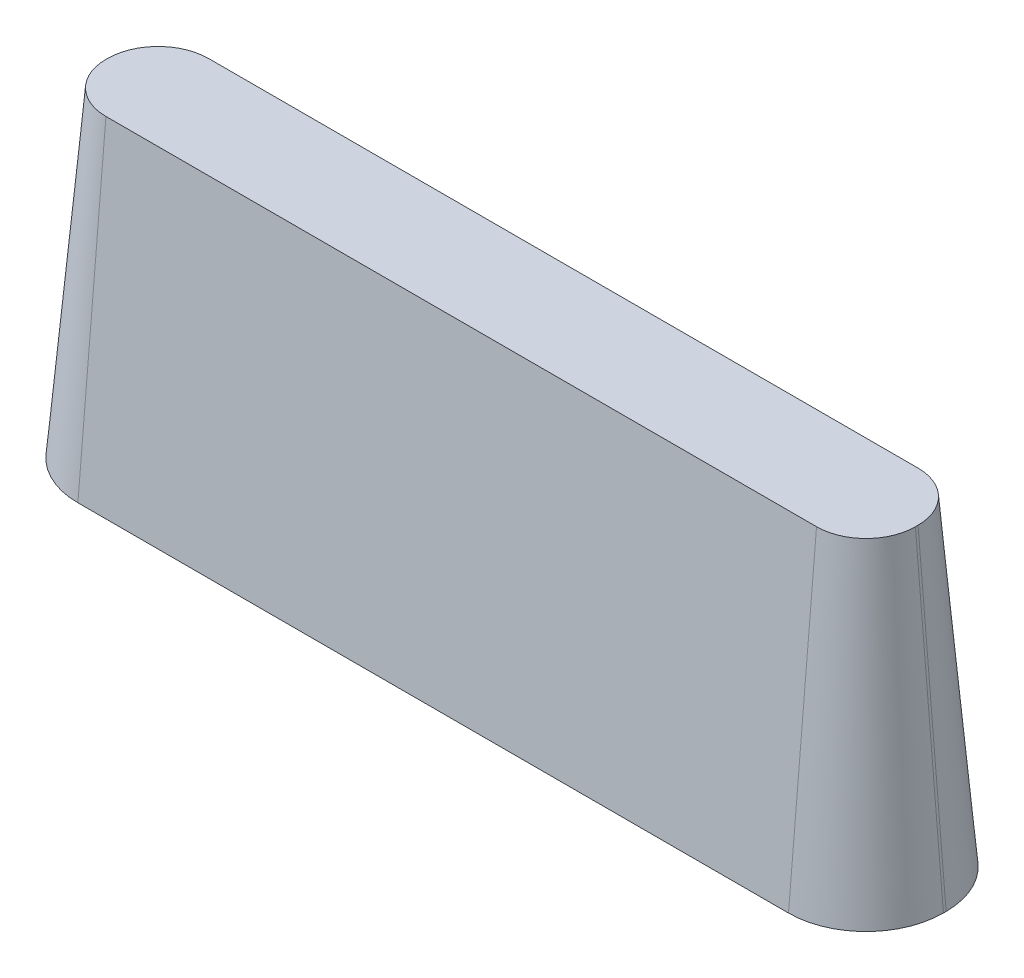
ISO-10303-21;
HEADER;
FILE_DESCRIPTION(('STEP AP214'),'2;1');
FILE_NAME('part.step','',(''),(''),'','','');
FILE_SCHEMA(('AUTOMOTIVE_DESIGN { 1 0 10303 214 1 1 1 1 }'));
ENDSEC;
DATA;
#1=APPLICATION_CONTEXT('core data for automotive mechanical design processes');
#2=APPLICATION_PROTOCOL_DEFINITION('international standard','automotive_design',2000,#1);
#3=PRODUCT_CONTEXT('',#1,'mechanical');
#4=PRODUCT('Part','Part','',(#3));
#5=PRODUCT_RELATED_PRODUCT_CATEGORY('part','',(#4));
#6=PRODUCT_DEFINITION_FORMATION('','',#4);
#7=PRODUCT_DEFINITION_CONTEXT('part definition',#1,'design');
#8=PRODUCT_DEFINITION('design','',#6,#7);
#9=PRODUCT_DEFINITION_SHAPE('','',#8);
#10=(LENGTH_UNIT() NAMED_UNIT(*) SI_UNIT(.MILLI.,.METRE.));
#11=(NAMED_UNIT(*) PLANE_ANGLE_UNIT() SI_UNIT($,.RADIAN.));
#12=(NAMED_UNIT(*) SI_UNIT($,.STERADIAN.) SOLID_ANGLE_UNIT());
#13=UNCERTAINTY_MEASURE_WITH_UNIT(LENGTH_MEASURE(1.E-05),#10,'distance_accuracy_value','');
#14=(GEOMETRIC_REPRESENTATION_CONTEXT(3) GLOBAL_UNCERTAINTY_ASSIGNED_CONTEXT((#13)) GLOBAL_UNIT_ASSIGNED_CONTEXT((#10,
#11,#12)) REPRESENTATION_CONTEXT('',''));
#15=CARTESIAN_POINT('',(0.,0.,0.));
#16=DIRECTION('',(0.,0.,1.));
#17=DIRECTION('',(1.,0.,0.));
#18=AXIS2_PLACEMENT_3D('',#15,#16,#17);
#19=CARTESIAN_POINT('',(79.4097630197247,0.,-292.536387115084));
#20=DIRECTION('',(0.,-1.,0.));
#21=DIRECTION('',(0.,0.,1.));
#22=AXIS2_PLACEMENT_3D('',#19,#20,#21);
#23=CONICAL_SURFACE('',#22,149.86,0.0872664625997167);
#24=CARTESIAN_POINT('',(79.4097630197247,0.,-292.536387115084));
#25=DIRECTION('',(0.,1.,0.));
#26=DIRECTION('',(0.,0.,1.));
#27=AXIS2_PLACEMENT_3D('',#24,#25,#26);
#28=CIRCLE('',#27,149.86);
#29=CARTESIAN_POINT('',(-70.4502369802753,0.,-292.536387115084));
#30=VERTEX_POINT('',#29);
#31=CARTESIAN_POINT('',(79.4097630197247,0.,-442.396387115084));
#32=VERTEX_POINT('',#31);
#33=EDGE_CURVE('E193',#30,#32,#28,.F.);
#34=ORIENTED_EDGE('',*,*,#33,.F.);
#35=DIRECTION('',(-0.0871557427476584,-0.996194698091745,0.));
#36=VECTOR('',#35,1.);
#37=CARTESIAN_POINT('',(-70.4502369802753,0.,-292.536387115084));
#38=LINE('',#37,#36);
#39=CARTESIAN_POINT('',(-17.1171476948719,609.6,-292.536387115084));
#40=VERTEX_POINT('',#39);
#41=EDGE_CURVE('E11',#40,#30,#38,.T.);
#42=ORIENTED_EDGE('',*,*,#41,.F.);
#43=CARTESIAN_POINT('',(79.4097630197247,609.6,-292.536387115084));
#44=DIRECTION('',(0.,1.,0.));
#45=DIRECTION('',(0.,0.,1.));
#46=AXIS2_PLACEMENT_3D('',#43,#44,#45);
#47=CIRCLE('',#46,96.5269107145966);
#48=CARTESIAN_POINT('',(79.4097630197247,609.6,-389.063297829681));
#49=VERTEX_POINT('',#48);
#50=EDGE_CURVE('E247',#40,#49,#47,.F.);
#51=ORIENTED_EDGE('',*,*,#50,.T.);
#52=DIRECTION('',(0.,-0.996194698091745,-0.0871557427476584));
#53=VECTOR('',#52,1.);
#54=CARTESIAN_POINT('',(79.4097630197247,0.,-442.396387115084));
#55=LINE('',#54,#53);
#56=EDGE_CURVE('E50',#49,#32,#55,.T.);
#57=ORIENTED_EDGE('',*,*,#56,.T.);
#58=EDGE_LOOP('',(#34,#42,#51,#57));
#59=FACE_BOUND('',#58,.T.);
#60=ADVANCED_FACE('F33',(#59),#23,.T.);
#61=CARTESIAN_POINT('',(-70.4502369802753,0.,-292.536387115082));
#62=DIRECTION('',(-0.996194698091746,0.0871557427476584,0.));
#63=DIRECTION('',(-0.0871557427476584,-0.996194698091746,0.));
#64=AXIS2_PLACEMENT_3D('',#61,#62,#63);
#65=PLANE('',#64);
#66=DIRECTION('',(0.,0.,1.));
#67=VECTOR('',#66,1.);
#68=CARTESIAN_POINT('',(-70.4502369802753,0.,-292.536387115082));
#69=LINE('',#68,#67);
#70=CARTESIAN_POINT('',(-70.4502369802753,0.,-289.996387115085));
#71=VERTEX_POINT('',#70);
#72=EDGE_CURVE('E227',#30,#71,#69,.T.);
#73=ORIENTED_EDGE('',*,*,#72,.T.);
#74=DIRECTION('',(-0.0871557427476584,-0.996194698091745,0.));
#75=VECTOR('',#74,1.);
#76=CARTESIAN_POINT('',(-70.4502369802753,0.,-289.996387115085));
#77=LINE('',#76,#75);
#78=CARTESIAN_POINT('',(-17.1171476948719,609.6,-289.996387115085));
#79=VERTEX_POINT('',#78);
#80=EDGE_CURVE('E42',#79,#71,#77,.T.);
#81=ORIENTED_EDGE('',*,*,#80,.F.);
#82=DIRECTION('',(0.,0.,-1.));
#83=VECTOR('',#82,1.);
#84=CARTESIAN_POINT('',(-17.1171476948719,609.6,-292.536387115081));
#85=LINE('',#84,#83);
#86=EDGE_CURVE('E261',#40,#79,#85,.F.);
#87=ORIENTED_EDGE('',*,*,#86,.F.);
#88=ORIENTED_EDGE('',*,*,#41,.T.);
#89=EDGE_LOOP('',(#73,#81,#87,#88));
#90=FACE_BOUND('',#89,.T.);
#91=ADVANCED_FACE('F35',(#90),#65,.T.);
#92=CARTESIAN_POINT('',(76.8697630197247,0.,-289.996387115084));
#93=DIRECTION('',(0.,-1.,0.));
#94=DIRECTION('',(0.,0.,1.));
#95=AXIS2_PLACEMENT_3D('',#92,#93,#94);
#96=CONICAL_SURFACE('',#95,147.32,0.0872664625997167);
#97=CARTESIAN_POINT('',(76.8697630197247,0.,-289.996387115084));
#98=DIRECTION('',(0.,1.,0.));
#99=DIRECTION('',(0.,0.,1.));
#100=AXIS2_PLACEMENT_3D('',#97,#98,#99);
#101=CIRCLE('',#100,147.32);
#102=CARTESIAN_POINT('',(76.8697630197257,0.,-142.676387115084));
#103=VERTEX_POINT('',#102);
#104=EDGE_CURVE('E230',#103,#71,#101,.F.);
#105=ORIENTED_EDGE('',*,*,#104,.F.);
#106=DIRECTION('',(0.,-0.996194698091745,0.0871557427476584));
#107=VECTOR('',#106,1.);
#108=CARTESIAN_POINT('',(76.8697630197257,0.,-142.676387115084));
#109=LINE('',#108,#107);
#110=CARTESIAN_POINT('',(76.8697630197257,609.6,-196.009476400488));
#111=VERTEX_POINT('',#110);
#112=EDGE_CURVE('E257',#111,#103,#109,.T.);
#113=ORIENTED_EDGE('',*,*,#112,.F.);
#114=CARTESIAN_POINT('',(76.8697630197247,609.6,-289.996387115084));
#115=DIRECTION('',(0.,1.,0.));
#116=DIRECTION('',(0.,0.,1.));
#117=AXIS2_PLACEMENT_3D('',#114,#115,#116);
#118=CIRCLE('',#117,93.9869107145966);
#119=EDGE_CURVE('E263',#111,#79,#118,.F.);
#120=ORIENTED_EDGE('',*,*,#119,.T.);
#121=ORIENTED_EDGE('',*,*,#80,.T.);
#122=EDGE_LOOP('',(#105,#113,#120,#121));
#123=FACE_BOUND('',#122,.T.);
#124=ADVANCED_FACE('F299',(#123),#96,.T.);
#125=CARTESIAN_POINT('',(-553.509119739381,0.,-142.676387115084));
#126=DIRECTION('',(0.,0.0871557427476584,0.996194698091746));
#127=DIRECTION('',(0.,-0.996194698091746,0.0871557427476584));
#128=AXIS2_PLACEMENT_3D('',#125,#126,#127);
#129=PLANE('',#128);
#130=DIRECTION('',(1.,0.,0.));
#131=VECTOR('',#130,1.);
#132=CARTESIAN_POINT('',(-553.509119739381,0.,-142.676387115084));
#133=LINE('',#132,#131);
#134=CARTESIAN_POINT('',(1428.14976301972,0.,-142.676387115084));
#135=VERTEX_POINT('',#134);
#136=EDGE_CURVE('E233',#103,#135,#133,.T.);
#137=ORIENTED_EDGE('',*,*,#136,.T.);
#138=DIRECTION('',(0.,-0.996194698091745,0.0871557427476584));
#139=VECTOR('',#138,1.);
#140=CARTESIAN_POINT('',(1428.14976301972,0.,-142.676387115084));
#141=LINE('',#140,#139);
#142=CARTESIAN_POINT('',(1428.14976301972,609.6,-196.009476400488));
#143=VERTEX_POINT('',#142);
#144=EDGE_CURVE('E255',#143,#135,#141,.T.);
#145=ORIENTED_EDGE('',*,*,#144,.F.);
#146=DIRECTION('',(-1.,0.,0.));
#147=VECTOR('',#146,1.);
#148=CARTESIAN_POINT('',(-553.509119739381,609.6,-196.009476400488));
#149=LINE('',#148,#147);
#150=EDGE_CURVE('E266',#111,#143,#149,.F.);
#151=ORIENTED_EDGE('',*,*,#150,.F.);
#152=ORIENTED_EDGE('',*,*,#112,.T.);
#153=EDGE_LOOP('',(#137,#145,#151,#152));
#154=FACE_BOUND('',#153,.T.);
#155=ADVANCED_FACE('F302',(#154),#129,.T.);
#156=CARTESIAN_POINT('',(1428.14976301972,0.,-289.996387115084));
#157=DIRECTION('',(0.,-1.,0.));
#158=DIRECTION('',(0.,0.,1.));
#159=AXIS2_PLACEMENT_3D('',#156,#157,#158);
#160=CONICAL_SURFACE('',#159,147.32,0.0872664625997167);
#161=CARTESIAN_POINT('',(1428.14976301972,0.,-289.996387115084));
#162=DIRECTION('',(0.,1.,0.));
#163=DIRECTION('',(0.,0.,1.));
#164=AXIS2_PLACEMENT_3D('',#161,#162,#163);
#165=CIRCLE('',#164,147.32);
#166=CARTESIAN_POINT('',(1575.46976301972,0.,-289.996387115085));
#167=VERTEX_POINT('',#166);
#168=EDGE_CURVE('E236',#167,#135,#165,.F.);
#169=ORIENTED_EDGE('',*,*,#168,.F.);
#170=DIRECTION('',(0.0871557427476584,-0.996194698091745,0.));
#171=VECTOR('',#170,1.);
#172=CARTESIAN_POINT('',(1575.46976301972,0.,-289.996387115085));
#173=LINE('',#172,#171);
#174=CARTESIAN_POINT('',(1522.13667373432,609.6,-289.996387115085));
#175=VERTEX_POINT('',#174);
#176=EDGE_CURVE('E253',#175,#167,#173,.T.);
#177=ORIENTED_EDGE('',*,*,#176,.F.);
#178=CARTESIAN_POINT('',(1428.14976301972,609.6,-289.996387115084));
#179=DIRECTION('',(0.,1.,0.));
#180=DIRECTION('',(0.,0.,1.));
#181=AXIS2_PLACEMENT_3D('',#178,#179,#180);
#182=CIRCLE('',#181,93.9869107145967);
#183=EDGE_CURVE('E268',#175,#143,#182,.F.);
#184=ORIENTED_EDGE('',*,*,#183,.T.);
#185=ORIENTED_EDGE('',*,*,#144,.T.);
#186=EDGE_LOOP('',(#169,#177,#184,#185));
#187=FACE_BOUND('',#186,.T.);
#188=ADVANCED_FACE('F304',(#187),#160,.T.);
#189=CARTESIAN_POINT('',(1575.46976301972,0.,-292.536387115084));
#190=DIRECTION('',(0.996194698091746,0.0871557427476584,0.));
#191=DIRECTION('',(-0.0871557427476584,0.996194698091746,0.));
#192=AXIS2_PLACEMENT_3D('',#189,#190,#191);
#193=PLANE('',#192);
#194=DIRECTION('',(0.,0.,1.));
#195=VECTOR('',#194,1.);
#196=CARTESIAN_POINT('',(1575.46976301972,0.,-292.536387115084));
#197=LINE('',#196,#195);
#198=CARTESIAN_POINT('',(1575.46976301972,0.,-295.076387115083));
#199=VERTEX_POINT('',#198);
#200=EDGE_CURVE('E239',#199,#167,#197,.T.);
#201=ORIENTED_EDGE('',*,*,#200,.F.);
#202=DIRECTION('',(0.0871557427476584,-0.996194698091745,0.));
#203=VECTOR('',#202,1.);
#204=CARTESIAN_POINT('',(1575.46976301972,0.,-295.076387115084));
#205=LINE('',#204,#203);
#206=CARTESIAN_POINT('',(1522.13667373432,609.6,-295.076387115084));
#207=VERTEX_POINT('',#206);
#208=EDGE_CURVE('E251',#207,#199,#205,.T.);
#209=ORIENTED_EDGE('',*,*,#208,.F.);
#210=DIRECTION('',(0.,0.,1.));
#211=VECTOR('',#210,1.);
#212=CARTESIAN_POINT('',(1522.13667373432,609.6,-292.536387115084));
#213=LINE('',#212,#211);
#214=EDGE_CURVE('E271',#207,#175,#213,.T.);
#215=ORIENTED_EDGE('',*,*,#214,.T.);
#216=ORIENTED_EDGE('',*,*,#176,.T.);
#217=EDGE_LOOP('',(#201,#209,#215,#216));
#218=FACE_BOUND('',#217,.T.);
#219=ADVANCED_FACE('F283',(#218),#193,.T.);
#220=CARTESIAN_POINT('',(1428.14976301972,0.,-295.076387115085));
#221=DIRECTION('',(0.,-1.,0.));
#222=DIRECTION('',(0.,0.,1.));
#223=AXIS2_PLACEMENT_3D('',#220,#221,#222);
#224=CONICAL_SURFACE('',#223,147.32,0.0872664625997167);
#225=CARTESIAN_POINT('',(1428.14976301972,0.,-295.076387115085));
#226=DIRECTION('',(0.,1.,0.));
#227=DIRECTION('',(0.,0.,1.));
#228=AXIS2_PLACEMENT_3D('',#225,#226,#227);
#229=CIRCLE('',#228,147.32);
#230=CARTESIAN_POINT('',(1428.14976301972,0.,-442.396387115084));
#231=VERTEX_POINT('',#230);
#232=EDGE_CURVE('E242',#231,#199,#229,.F.);
#233=ORIENTED_EDGE('',*,*,#232,.F.);
#234=DIRECTION('',(0.,-0.996194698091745,-0.0871557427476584));
#235=VECTOR('',#234,1.);
#236=CARTESIAN_POINT('',(1428.14976301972,0.,-442.396387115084));
#237=LINE('',#236,#235);
#238=CARTESIAN_POINT('',(1428.14976301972,609.6,-389.063297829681));
#239=VERTEX_POINT('',#238);
#240=EDGE_CURVE('E58',#239,#231,#237,.T.);
#241=ORIENTED_EDGE('',*,*,#240,.F.);
#242=CARTESIAN_POINT('',(1428.14976301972,609.6,-295.076387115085));
#243=DIRECTION('',(0.,1.,0.));
#244=DIRECTION('',(0.,0.,1.));
#245=AXIS2_PLACEMENT_3D('',#242,#243,#244);
#246=CIRCLE('',#245,93.9869107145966);
#247=EDGE_CURVE('E273',#239,#207,#246,.F.);
#248=ORIENTED_EDGE('',*,*,#247,.T.);
#249=ORIENTED_EDGE('',*,*,#208,.T.);
#250=EDGE_LOOP('',(#233,#241,#248,#249));
#251=FACE_BOUND('',#250,.T.);
#252=ADVANCED_FACE('F285',(#251),#224,.T.);
#253=CARTESIAN_POINT('',(-553.509119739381,0.,-442.396387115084));
#254=DIRECTION('',(0.,0.0871557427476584,-0.996194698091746));
#255=DIRECTION('',(0.,0.996194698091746,0.0871557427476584));
#256=AXIS2_PLACEMENT_3D('',#253,#254,#255);
#257=PLANE('',#256);
#258=DIRECTION('',(1.,0.,0.));
#259=VECTOR('',#258,1.);
#260=CARTESIAN_POINT('',(-553.509119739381,0.,-442.396387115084));
#261=LINE('',#260,#259);
#262=EDGE_CURVE('E245',#32,#231,#261,.T.);
#263=ORIENTED_EDGE('',*,*,#262,.F.);
#264=ORIENTED_EDGE('',*,*,#56,.F.);
#265=DIRECTION('',(1.,0.,0.));
#266=VECTOR('',#265,1.);
#267=CARTESIAN_POINT('',(-553.509119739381,609.6,-389.063297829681));
#268=LINE('',#267,#266);
#269=EDGE_CURVE('E37',#49,#239,#268,.T.);
#270=ORIENTED_EDGE('',*,*,#269,.T.);
#271=ORIENTED_EDGE('',*,*,#240,.T.);
#272=EDGE_LOOP('',(#263,#264,#270,#271));
#273=FACE_BOUND('',#272,.T.);
#274=ADVANCED_FACE('F275',(#273),#257,.T.);
#275=CARTESIAN_POINT('',(-553.509119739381,609.6,-292.536387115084));
#276=DIRECTION('',(0.,1.,0.));
#277=DIRECTION('',(0.,0.,1.));
#278=AXIS2_PLACEMENT_3D('',#275,#276,#277);
#279=PLANE('',#278);
#280=ORIENTED_EDGE('',*,*,#50,.F.);
#281=ORIENTED_EDGE('',*,*,#86,.T.);
#282=ORIENTED_EDGE('',*,*,#119,.F.);
#283=ORIENTED_EDGE('',*,*,#150,.T.);
#284=ORIENTED_EDGE('',*,*,#183,.F.);
#285=ORIENTED_EDGE('',*,*,#214,.F.);
#286=ORIENTED_EDGE('',*,*,#247,.F.);
#287=ORIENTED_EDGE('',*,*,#269,.F.);
#288=EDGE_LOOP('',(#280,#281,#282,#283,#284,#285,#286,#287));
#289=FACE_BOUND('',#288,.T.);
#290=ADVANCED_FACE('F278',(#289),#279,.T.);
#291=CARTESIAN_POINT('',(-553.509119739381,0.,-292.536387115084));
#292=DIRECTION('',(0.,1.,0.));
#293=DIRECTION('',(0.,0.,1.));
#294=AXIS2_PLACEMENT_3D('',#291,#292,#293);
#295=PLANE('',#294);
#296=ORIENTED_EDGE('',*,*,#33,.T.);
#297=ORIENTED_EDGE('',*,*,#262,.T.);
#298=ORIENTED_EDGE('',*,*,#232,.T.);
#299=ORIENTED_EDGE('',*,*,#200,.T.);
#300=ORIENTED_EDGE('',*,*,#168,.T.);
#301=ORIENTED_EDGE('',*,*,#136,.F.);
#302=ORIENTED_EDGE('',*,*,#104,.T.);
#303=ORIENTED_EDGE('',*,*,#72,.F.);
#304=EDGE_LOOP('',(#296,#297,#298,#299,#300,#301,#302,#303));
#305=FACE_BOUND('',#304,.T.);
#306=ADVANCED_FACE('F287',(#305),#295,.F.);
#307=CLOSED_SHELL('',(#60,#91,#124,#155,#188,#219,#252,#274,#290,#306));
#308=CARTESIAN_POINT('',(79.4097630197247,2.54,-292.536387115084));
#309=DIRECTION('',(0.,-1.,0.));
#310=DIRECTION('',(0.,0.,-1.));
#311=AXIS2_PLACEMENT_3D('',#308,#309,#310);
#312=CONICAL_SURFACE('',#311,147.32,0.0872664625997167);
#313=CARTESIAN_POINT('',(79.4097630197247,2.54,-292.536387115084));
#314=DIRECTION('',(0.,-1.,0.));
#315=DIRECTION('',(0.,0.,-1.));
#316=AXIS2_PLACEMENT_3D('',#313,#314,#315);
#317=CIRCLE('',#316,147.32);
#318=CARTESIAN_POINT('',(-67.9102369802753,2.54,-292.536387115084));
#319=VERTEX_POINT('',#318);
#320=CARTESIAN_POINT('',(79.4097630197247,2.54,-439.856387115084));
#321=VERTEX_POINT('',#320);
#322=EDGE_CURVE('E167',#319,#321,#317,.T.);
#323=ORIENTED_EDGE('',*,*,#322,.T.);
#324=DIRECTION('',(0.,-0.996194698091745,-0.0871557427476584));
#325=VECTOR('',#324,1.);
#326=CARTESIAN_POINT('',(79.4097630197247,2.54,-439.856387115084));
#327=LINE('',#326,#325);
#328=CARTESIAN_POINT('',(79.4097630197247,607.06,-386.967740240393));
#329=VERTEX_POINT('',#328);
#330=EDGE_CURVE('E149',#329,#321,#327,.T.);
#331=ORIENTED_EDGE('',*,*,#330,.F.);
#332=CARTESIAN_POINT('',(79.4097630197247,607.06,-292.536387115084));
#333=DIRECTION('',(0.,-1.,0.));
#334=DIRECTION('',(0.,0.,-1.));
#335=AXIS2_PLACEMENT_3D('',#332,#333,#334);
#336=CIRCLE('',#335,94.4313531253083);
#337=CARTESIAN_POINT('',(-15.0215901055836,607.06,-292.536387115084));
#338=VERTEX_POINT('',#337);
#339=EDGE_CURVE('E192',#338,#329,#336,.T.);
#340=ORIENTED_EDGE('',*,*,#339,.F.);
#341=DIRECTION('',(-0.0871557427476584,-0.996194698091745,0.));
#342=VECTOR('',#341,1.);
#343=CARTESIAN_POINT('',(-67.9102369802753,2.54,-292.536387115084));
#344=LINE('',#343,#342);
#345=EDGE_CURVE('E174',#338,#319,#344,.T.);
#346=ORIENTED_EDGE('',*,*,#345,.T.);
#347=EDGE_LOOP('',(#323,#331,#340,#346));
#348=FACE_BOUND('',#347,.T.);
#349=ADVANCED_FACE('F173',(#348),#312,.F.);
#350=CARTESIAN_POINT('',(-67.9102369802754,2.54,-289.996387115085));
#351=DIRECTION('',(-0.996194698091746,0.0871557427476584,0.));
#352=DIRECTION('',(-0.0871557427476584,-0.996194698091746,0.));
#353=AXIS2_PLACEMENT_3D('',#350,#351,#352);
#354=PLANE('',#353);
#355=DIRECTION('',(0.,0.,-1.));
#356=VECTOR('',#355,1.);
#357=CARTESIAN_POINT('',(-67.9102369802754,2.54,-289.996387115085));
#358=LINE('',#357,#356);
#359=CARTESIAN_POINT('',(-67.9102369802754,2.54,-289.996387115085));
#360=VERTEX_POINT('',#359);
#361=EDGE_CURVE('E190',#360,#319,#358,.T.);
#362=ORIENTED_EDGE('',*,*,#361,.T.);
#363=ORIENTED_EDGE('',*,*,#345,.F.);
#364=DIRECTION('',(0.,0.,-1.));
#365=VECTOR('',#364,1.);
#366=CARTESIAN_POINT('',(-15.0215901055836,607.06,-292.536387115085));
#367=LINE('',#366,#365);
#368=CARTESIAN_POINT('',(-15.0215901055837,607.06,-289.996387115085));
#369=VERTEX_POINT('',#368);
#370=EDGE_CURVE('E160',#369,#338,#367,.T.);
#371=ORIENTED_EDGE('',*,*,#370,.F.);
#372=DIRECTION('',(-0.0871557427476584,-0.996194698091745,0.));
#373=VECTOR('',#372,1.);
#374=CARTESIAN_POINT('',(-67.9102369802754,2.54,-289.996387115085));
#375=LINE('',#374,#373);
#376=EDGE_CURVE('E194',#369,#360,#375,.T.);
#377=ORIENTED_EDGE('',*,*,#376,.T.);
#378=EDGE_LOOP('',(#362,#363,#371,#377));
#379=FACE_BOUND('',#378,.T.);
#380=ADVANCED_FACE('F348',(#379),#354,.F.);
#381=CARTESIAN_POINT('',(76.8697630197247,2.54,-289.996387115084));
#382=DIRECTION('',(0.,-1.,0.));
#383=DIRECTION('',(0.,0.,-1.));
#384=AXIS2_PLACEMENT_3D('',#381,#382,#383);
#385=CONICAL_SURFACE('',#384,144.78,0.0872664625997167);
#386=CARTESIAN_POINT('',(76.8697630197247,2.54,-289.996387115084));
#387=DIRECTION('',(0.,-1.,0.));
#388=DIRECTION('',(0.,0.,-1.));
#389=AXIS2_PLACEMENT_3D('',#386,#387,#388);
#390=CIRCLE('',#389,144.78);
#391=CARTESIAN_POINT('',(76.8697630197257,2.54,-145.216387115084));
#392=VERTEX_POINT('',#391);
#393=EDGE_CURVE('E187',#392,#360,#390,.T.);
#394=ORIENTED_EDGE('',*,*,#393,.T.);
#395=ORIENTED_EDGE('',*,*,#376,.F.);
#396=CARTESIAN_POINT('',(76.8697630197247,607.06,-289.996387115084));
#397=DIRECTION('',(0.,-1.,0.));
#398=DIRECTION('',(0.,0.,-1.));
#399=AXIS2_PLACEMENT_3D('',#396,#397,#398);
#400=CIRCLE('',#399,91.8913531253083);
#401=CARTESIAN_POINT('',(76.8697630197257,607.06,-198.105033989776));
#402=VERTEX_POINT('',#401);
#403=EDGE_CURVE('E209',#402,#369,#400,.T.);
#404=ORIENTED_EDGE('',*,*,#403,.F.);
#405=DIRECTION('',(0.,-0.996194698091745,0.0871557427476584));
#406=VECTOR('',#405,1.);
#407=CARTESIAN_POINT('',(76.8697630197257,2.54,-145.216387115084));
#408=LINE('',#407,#406);
#409=EDGE_CURVE('E203',#402,#392,#408,.T.);
#410=ORIENTED_EDGE('',*,*,#409,.T.);
#411=EDGE_LOOP('',(#394,#395,#404,#410));
#412=FACE_BOUND('',#411,.T.);
#413=ADVANCED_FACE('F356',(#412),#385,.F.);
#414=CARTESIAN_POINT('',(1428.14976301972,2.54,-145.216387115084));
#415=DIRECTION('',(0.,0.0871557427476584,0.996194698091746));
#416=DIRECTION('',(0.,-0.996194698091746,0.0871557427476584));
#417=AXIS2_PLACEMENT_3D('',#414,#415,#416);
#418=PLANE('',#417);
#419=DIRECTION('',(-1.,0.,0.));
#420=VECTOR('',#419,1.);
#421=CARTESIAN_POINT('',(1428.14976301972,2.54,-145.216387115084));
#422=LINE('',#421,#420);
#423=CARTESIAN_POINT('',(1428.14976301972,2.54,-145.216387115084));
#424=VERTEX_POINT('',#423);
#425=EDGE_CURVE('E184',#424,#392,#422,.T.);
#426=ORIENTED_EDGE('',*,*,#425,.T.);
#427=ORIENTED_EDGE('',*,*,#409,.F.);
#428=DIRECTION('',(-1.,0.,0.));
#429=VECTOR('',#428,1.);
#430=CARTESIAN_POINT('',(79.4097630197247,607.06,-198.105033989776));
#431=LINE('',#430,#429);
#432=CARTESIAN_POINT('',(1428.14976301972,607.06,-198.105033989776));
#433=VERTEX_POINT('',#432);
#434=EDGE_CURVE('E212',#433,#402,#431,.T.);
#435=ORIENTED_EDGE('',*,*,#434,.F.);
#436=DIRECTION('',(0.,-0.996194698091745,0.0871557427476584));
#437=VECTOR('',#436,1.);
#438=CARTESIAN_POINT('',(1428.14976301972,2.54000000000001,-145.216387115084));
#439=LINE('',#438,#437);
#440=EDGE_CURVE('E201',#433,#424,#439,.T.);
#441=ORIENTED_EDGE('',*,*,#440,.T.);
#442=EDGE_LOOP('',(#426,#427,#435,#441));
#443=FACE_BOUND('',#442,.T.);
#444=ADVANCED_FACE('F364',(#443),#418,.F.);
#445=CARTESIAN_POINT('',(1428.14976301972,2.54,-289.996387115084));
#446=DIRECTION('',(0.,-1.,0.));
#447=DIRECTION('',(0.,0.,-1.));
#448=AXIS2_PLACEMENT_3D('',#445,#446,#447);
#449=CONICAL_SURFACE('',#448,144.78,0.0872664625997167);
#450=CARTESIAN_POINT('',(1428.14976301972,2.54,-289.996387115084));
#451=DIRECTION('',(0.,-1.,0.));
#452=DIRECTION('',(0.,0.,-1.));
#453=AXIS2_PLACEMENT_3D('',#450,#451,#452);
#454=CIRCLE('',#453,144.78);
#455=CARTESIAN_POINT('',(1572.92976301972,2.54,-289.996387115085));
#456=VERTEX_POINT('',#455);
#457=EDGE_CURVE('E181',#456,#424,#454,.T.);
#458=ORIENTED_EDGE('',*,*,#457,.T.);
#459=ORIENTED_EDGE('',*,*,#440,.F.);
#460=CARTESIAN_POINT('',(1428.14976301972,607.06,-289.996387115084));
#461=DIRECTION('',(0.,-1.,0.));
#462=DIRECTION('',(0.,0.,-1.));
#463=AXIS2_PLACEMENT_3D('',#460,#461,#462);
#464=CIRCLE('',#463,91.8913531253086);
#465=CARTESIAN_POINT('',(1520.04111614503,607.06,-289.996387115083));
#466=VERTEX_POINT('',#465);
#467=EDGE_CURVE('E215',#466,#433,#464,.T.);
#468=ORIENTED_EDGE('',*,*,#467,.F.);
#469=DIRECTION('',(0.0871557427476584,-0.996194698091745,0.));
#470=VECTOR('',#469,1.);
#471=CARTESIAN_POINT('',(1572.92976301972,2.54,-289.996387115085));
#472=LINE('',#471,#470);
#473=EDGE_CURVE('E199',#466,#456,#472,.T.);
#474=ORIENTED_EDGE('',*,*,#473,.T.);
#475=EDGE_LOOP('',(#458,#459,#468,#474));
#476=FACE_BOUND('',#475,.T.);
#477=ADVANCED_FACE('F372',(#476),#449,.F.);
#478=CARTESIAN_POINT('',(1572.92976301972,2.54,-295.076387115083));
#479=DIRECTION('',(0.996194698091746,0.0871557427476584,0.));
#480=DIRECTION('',(-0.0871557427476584,0.996194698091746,0.));
#481=AXIS2_PLACEMENT_3D('',#478,#479,#480);
#482=PLANE('',#481);
#483=DIRECTION('',(0.,0.,1.));
#484=VECTOR('',#483,1.);
#485=CARTESIAN_POINT('',(1572.92976301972,2.54,-295.076387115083));
#486=LINE('',#485,#484);
#487=CARTESIAN_POINT('',(1572.92976301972,2.54,-295.076387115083));
#488=VERTEX_POINT('',#487);
#489=EDGE_CURVE('E178',#488,#456,#486,.T.);
#490=ORIENTED_EDGE('',*,*,#489,.T.);
#491=ORIENTED_EDGE('',*,*,#473,.F.);
#492=DIRECTION('',(0.,0.,1.));
#493=VECTOR('',#492,1.);
#494=CARTESIAN_POINT('',(1520.04111614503,607.06,-292.536387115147));
#495=LINE('',#494,#493);
#496=CARTESIAN_POINT('',(1520.04111614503,607.06,-295.076387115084));
#497=VERTEX_POINT('',#496);
#498=EDGE_CURVE('E218',#497,#466,#495,.T.);
#499=ORIENTED_EDGE('',*,*,#498,.F.);
#500=DIRECTION('',(0.0871557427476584,-0.996194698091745,0.));
#501=VECTOR('',#500,1.);
#502=CARTESIAN_POINT('',(1572.92976301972,2.53999999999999,-295.076387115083));
#503=LINE('',#502,#501);
#504=EDGE_CURVE('E197',#497,#488,#503,.T.);
#505=ORIENTED_EDGE('',*,*,#504,.T.);
#506=EDGE_LOOP('',(#490,#491,#499,#505));
#507=FACE_BOUND('',#506,.T.);
#508=ADVANCED_FACE('F380',(#507),#482,.F.);
#509=CARTESIAN_POINT('',(1428.14976301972,2.54,-295.076387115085));
#510=DIRECTION('',(0.,-1.,0.));
#511=DIRECTION('',(0.,0.,-1.));
#512=AXIS2_PLACEMENT_3D('',#509,#510,#511);
#513=CONICAL_SURFACE('',#512,144.78,0.0872664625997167);
#514=CARTESIAN_POINT('',(1428.14976301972,2.54,-295.076387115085));
#515=DIRECTION('',(0.,-1.,0.));
#516=DIRECTION('',(0.,0.,-1.));
#517=AXIS2_PLACEMENT_3D('',#514,#515,#516);
#518=CIRCLE('',#517,144.78);
#519=CARTESIAN_POINT('',(1428.14976301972,2.54,-439.856387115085));
#520=VERTEX_POINT('',#519);
#521=EDGE_CURVE('E171',#520,#488,#518,.T.);
#522=ORIENTED_EDGE('',*,*,#521,.T.);
#523=ORIENTED_EDGE('',*,*,#504,.F.);
#524=CARTESIAN_POINT('',(1428.14976301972,607.06,-295.076387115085));
#525=DIRECTION('',(0.,-1.,0.));
#526=DIRECTION('',(0.,0.,-1.));
#527=AXIS2_PLACEMENT_3D('',#524,#525,#526);
#528=CIRCLE('',#527,91.8913531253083);
#529=CARTESIAN_POINT('',(1428.14976301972,607.06,-386.967740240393));
#530=VERTEX_POINT('',#529);
#531=EDGE_CURVE('E221',#530,#497,#528,.T.);
#532=ORIENTED_EDGE('',*,*,#531,.F.);
#533=DIRECTION('',(0.,-0.996194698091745,-0.0871557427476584));
#534=VECTOR('',#533,1.);
#535=CARTESIAN_POINT('',(1428.14976301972,2.53999999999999,-439.856387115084));
#536=LINE('',#535,#534);
#537=EDGE_CURVE('E159',#530,#520,#536,.T.);
#538=ORIENTED_EDGE('',*,*,#537,.T.);
#539=EDGE_LOOP('',(#522,#523,#532,#538));
#540=FACE_BOUND('',#539,.T.);
#541=ADVANCED_FACE('F388',(#540),#513,.F.);
#542=CARTESIAN_POINT('',(79.4097630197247,2.54,-439.856387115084));
#543=DIRECTION('',(0.,0.0871557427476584,-0.996194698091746));
#544=DIRECTION('',(0.,0.996194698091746,0.0871557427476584));
#545=AXIS2_PLACEMENT_3D('',#542,#543,#544);
#546=PLANE('',#545);
#547=DIRECTION('',(1.,0.,0.));
#548=VECTOR('',#547,1.);
#549=CARTESIAN_POINT('',(79.4097630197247,2.54,-439.856387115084));
#550=LINE('',#549,#548);
#551=EDGE_CURVE('E152',#321,#520,#550,.T.);
#552=ORIENTED_EDGE('',*,*,#551,.T.);
#553=ORIENTED_EDGE('',*,*,#537,.F.);
#554=DIRECTION('',(1.,0.,0.));
#555=VECTOR('',#554,1.);
#556=CARTESIAN_POINT('',(79.4097630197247,607.06,-386.967740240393));
#557=LINE('',#556,#555);
#558=EDGE_CURVE('E154',#329,#530,#557,.T.);
#559=ORIENTED_EDGE('',*,*,#558,.F.);
#560=ORIENTED_EDGE('',*,*,#330,.T.);
#561=EDGE_LOOP('',(#552,#553,#559,#560));
#562=FACE_BOUND('',#561,.T.);
#563=ADVANCED_FACE('F151',(#562),#546,.F.);
#564=CARTESIAN_POINT('',(79.4097630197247,607.06,-292.536387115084));
#565=DIRECTION('',(0.,-1.,0.));
#566=DIRECTION('',(0.,0.,-1.));
#567=AXIS2_PLACEMENT_3D('',#564,#565,#566);
#568=PLANE('',#567);
#569=ORIENTED_EDGE('',*,*,#339,.T.);
#570=ORIENTED_EDGE('',*,*,#558,.T.);
#571=ORIENTED_EDGE('',*,*,#531,.T.);
#572=ORIENTED_EDGE('',*,*,#498,.T.);
#573=ORIENTED_EDGE('',*,*,#467,.T.);
#574=ORIENTED_EDGE('',*,*,#434,.T.);
#575=ORIENTED_EDGE('',*,*,#403,.T.);
#576=ORIENTED_EDGE('',*,*,#370,.T.);
#577=EDGE_LOOP('',(#569,#570,#571,#572,#573,#574,#575,#576));
#578=FACE_BOUND('',#577,.T.);
#579=ADVANCED_FACE('F403',(#578),#568,.T.);
#580=CARTESIAN_POINT('',(79.4097630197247,2.54,-292.536387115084));
#581=DIRECTION('',(0.,-1.,0.));
#582=DIRECTION('',(0.,0.,-1.));
#583=AXIS2_PLACEMENT_3D('',#580,#581,#582);
#584=PLANE('',#583);
#585=ORIENTED_EDGE('',*,*,#322,.F.);
#586=ORIENTED_EDGE('',*,*,#361,.F.);
#587=ORIENTED_EDGE('',*,*,#393,.F.);
#588=ORIENTED_EDGE('',*,*,#425,.F.);
#589=ORIENTED_EDGE('',*,*,#457,.F.);
#590=ORIENTED_EDGE('',*,*,#489,.F.);
#591=ORIENTED_EDGE('',*,*,#521,.F.);
#592=ORIENTED_EDGE('',*,*,#551,.F.);
#593=EDGE_LOOP('',(#585,#586,#587,#588,#589,#590,#591,#592));
#594=FACE_BOUND('',#593,.T.);
#595=ADVANCED_FACE('F165',(#594),#584,.F.);
#596=CLOSED_SHELL('',(#349,#380,#413,#444,#477,#508,#541,#563,#579,#595));
#597=ORIENTED_CLOSED_SHELL('',*,#596,.T.);
#598=BREP_WITH_VOIDS('B2',#307,(#597));
#599=ADVANCED_BREP_SHAPE_REPRESENTATION('',(#18,#598),#14);
#600=SHAPE_DEFINITION_REPRESENTATION(#9,#599);
ENDSEC;
END-ISO-10303-21;
